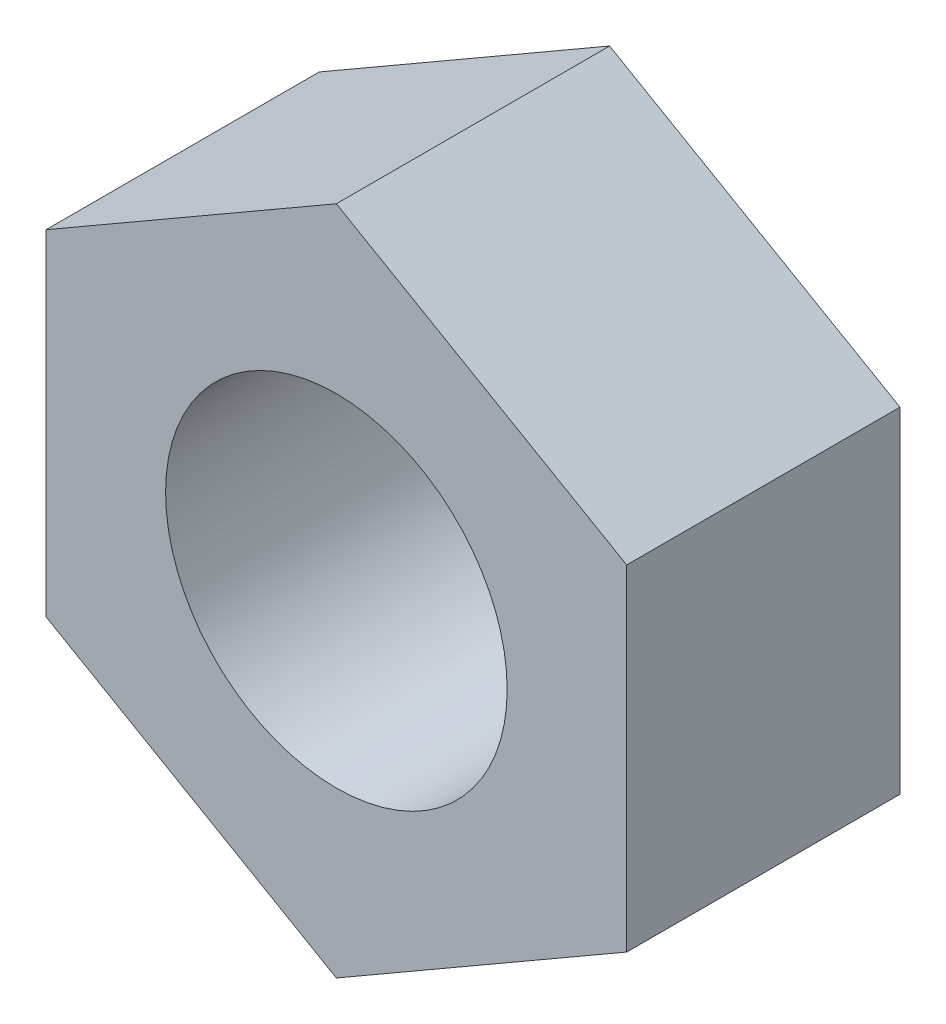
ISO-10303-21;
HEADER;
FILE_DESCRIPTION(('STEP AP214'),'2;1');
FILE_NAME('part.step','',(''),(''),'','','');
FILE_SCHEMA(('AUTOMOTIVE_DESIGN { 1 0 10303 214 1 1 1 1 }'));
ENDSEC;
DATA;
#1=APPLICATION_CONTEXT('core data for automotive mechanical design processes');
#2=APPLICATION_PROTOCOL_DEFINITION('international standard','automotive_design',2000,#1);
#3=PRODUCT_CONTEXT('',#1,'mechanical');
#4=PRODUCT('Part','Part','',(#3));
#5=PRODUCT_RELATED_PRODUCT_CATEGORY('part','',(#4));
#6=PRODUCT_DEFINITION_FORMATION('','',#4);
#7=PRODUCT_DEFINITION_CONTEXT('part definition',#1,'design');
#8=PRODUCT_DEFINITION('design','',#6,#7);
#9=PRODUCT_DEFINITION_SHAPE('','',#8);
#10=(LENGTH_UNIT() NAMED_UNIT(*) SI_UNIT(.MILLI.,.METRE.));
#11=(NAMED_UNIT(*) PLANE_ANGLE_UNIT() SI_UNIT($,.RADIAN.));
#12=(NAMED_UNIT(*) SI_UNIT($,.STERADIAN.) SOLID_ANGLE_UNIT());
#13=UNCERTAINTY_MEASURE_WITH_UNIT(LENGTH_MEASURE(1.E-05),#10,'distance_accuracy_value','');
#14=(GEOMETRIC_REPRESENTATION_CONTEXT(3) GLOBAL_UNCERTAINTY_ASSIGNED_CONTEXT((#13)) GLOBAL_UNIT_ASSIGNED_CONTEXT((#10,
#11,#12)) REPRESENTATION_CONTEXT('',''));
#15=CARTESIAN_POINT('',(0.,0.,0.));
#16=DIRECTION('',(0.,0.,1.));
#17=DIRECTION('',(1.,0.,0.));
#18=AXIS2_PLACEMENT_3D('',#15,#16,#17);
#19=CARTESIAN_POINT('',(0.,0.,8.));
#20=DIRECTION('',(0.,0.,1.));
#21=DIRECTION('',(1.,0.,0.));
#22=AXIS2_PLACEMENT_3D('',#19,#20,#21);
#23=PLANE('',#22);
#24=DIRECTION('',(0.866025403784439,0.5,0.));
#25=VECTOR('',#24,1.);
#26=CARTESIAN_POINT('',(0.,-9.81495457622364,8.));
#27=LINE('',#26,#25);
#28=CARTESIAN_POINT('',(0.,-9.81495457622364,8.));
#29=VERTEX_POINT('',#28);
#30=CARTESIAN_POINT('',(8.5,-4.90747728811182,8.));
#31=VERTEX_POINT('',#30);
#32=EDGE_CURVE('E129',#29,#31,#27,.T.);
#33=ORIENTED_EDGE('',*,*,#32,.T.);
#34=DIRECTION('',(0.,1.,0.));
#35=VECTOR('',#34,1.);
#36=CARTESIAN_POINT('',(8.5,-4.90747728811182,8.));
#37=LINE('',#36,#35);
#38=CARTESIAN_POINT('',(8.5,4.90747728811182,8.));
#39=VERTEX_POINT('',#38);
#40=EDGE_CURVE('E87',#31,#39,#37,.T.);
#41=ORIENTED_EDGE('',*,*,#40,.T.);
#42=DIRECTION('',(-0.866025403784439,0.5,0.));
#43=VECTOR('',#42,1.);
#44=CARTESIAN_POINT('',(8.5,4.90747728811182,8.));
#45=LINE('',#44,#43);
#46=CARTESIAN_POINT('',(0.,9.81495457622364,8.));
#47=VERTEX_POINT('',#46);
#48=EDGE_CURVE('E100',#39,#47,#45,.T.);
#49=ORIENTED_EDGE('',*,*,#48,.T.);
#50=DIRECTION('',(-0.866025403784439,-0.5,0.));
#51=VECTOR('',#50,1.);
#52=CARTESIAN_POINT('',(0.,9.81495457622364,8.));
#53=LINE('',#52,#51);
#54=CARTESIAN_POINT('',(-8.5,4.90747728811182,8.));
#55=VERTEX_POINT('',#54);
#56=EDGE_CURVE('E94',#47,#55,#53,.T.);
#57=ORIENTED_EDGE('',*,*,#56,.T.);
#58=DIRECTION('',(0.,-1.,0.));
#59=VECTOR('',#58,1.);
#60=CARTESIAN_POINT('',(-8.5,4.90747728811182,8.));
#61=LINE('',#60,#59);
#62=CARTESIAN_POINT('',(-8.5,-4.90747728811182,8.));
#63=VERTEX_POINT('',#62);
#64=EDGE_CURVE('E98',#55,#63,#61,.T.);
#65=ORIENTED_EDGE('',*,*,#64,.T.);
#66=DIRECTION('',(0.866025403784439,-0.5,0.));
#67=VECTOR('',#66,1.);
#68=CARTESIAN_POINT('',(-8.5,-4.90747728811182,8.));
#69=LINE('',#68,#67);
#70=EDGE_CURVE('E50',#63,#29,#69,.T.);
#71=ORIENTED_EDGE('',*,*,#70,.T.);
#72=EDGE_LOOP('',(#33,#41,#49,#57,#65,#71));
#73=FACE_BOUND('',#72,.T.);
#74=CARTESIAN_POINT('',(0.,0.,8.));
#75=DIRECTION('',(0.,0.,1.));
#76=DIRECTION('',(1.,0.,0.));
#77=AXIS2_PLACEMENT_3D('',#74,#75,#76);
#78=CIRCLE('',#77,5.);
#79=CARTESIAN_POINT('',(5.,0.,8.));
#80=VERTEX_POINT('',#79);
#81=EDGE_CURVE('E122',#80,#80,#78,.T.);
#82=ORIENTED_EDGE('',*,*,#81,.F.);
#83=EDGE_LOOP('',(#82));
#84=FACE_BOUND('',#83,.T.);
#85=ADVANCED_FACE('F33',(#73,#84),#23,.T.);
#86=CARTESIAN_POINT('',(0.,0.,0.));
#87=DIRECTION('',(0.,0.,1.));
#88=DIRECTION('',(1.,0.,0.));
#89=AXIS2_PLACEMENT_3D('',#86,#87,#88);
#90=PLANE('',#89);
#91=DIRECTION('',(0.866025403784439,0.5,0.));
#92=VECTOR('',#91,1.);
#93=CARTESIAN_POINT('',(0.,-9.81495457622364,0.));
#94=LINE('',#93,#92);
#95=CARTESIAN_POINT('',(0.,-9.81495457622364,0.));
#96=VERTEX_POINT('',#95);
#97=CARTESIAN_POINT('',(8.5,-4.90747728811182,0.));
#98=VERTEX_POINT('',#97);
#99=EDGE_CURVE('E118',#96,#98,#94,.T.);
#100=ORIENTED_EDGE('',*,*,#99,.F.);
#101=DIRECTION('',(0.866025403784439,-0.5,0.));
#102=VECTOR('',#101,1.);
#103=CARTESIAN_POINT('',(-8.5,-4.90747728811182,0.));
#104=LINE('',#103,#102);
#105=CARTESIAN_POINT('',(-8.5,-4.90747728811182,0.));
#106=VERTEX_POINT('',#105);
#107=EDGE_CURVE('E79',#106,#96,#104,.T.);
#108=ORIENTED_EDGE('',*,*,#107,.F.);
#109=DIRECTION('',(0.,-1.,0.));
#110=VECTOR('',#109,1.);
#111=CARTESIAN_POINT('',(-8.5,4.90747728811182,0.));
#112=LINE('',#111,#110);
#113=CARTESIAN_POINT('',(-8.5,4.90747728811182,0.));
#114=VERTEX_POINT('',#113);
#115=EDGE_CURVE('E73',#114,#106,#112,.T.);
#116=ORIENTED_EDGE('',*,*,#115,.F.);
#117=DIRECTION('',(-0.866025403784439,-0.5,0.));
#118=VECTOR('',#117,1.);
#119=CARTESIAN_POINT('',(0.,9.81495457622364,0.));
#120=LINE('',#119,#118);
#121=CARTESIAN_POINT('',(0.,9.81495457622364,0.));
#122=VERTEX_POINT('',#121);
#123=EDGE_CURVE('E108',#122,#114,#120,.T.);
#124=ORIENTED_EDGE('',*,*,#123,.F.);
#125=DIRECTION('',(-0.866025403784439,0.5,0.));
#126=VECTOR('',#125,1.);
#127=CARTESIAN_POINT('',(8.5,4.90747728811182,0.));
#128=LINE('',#127,#126);
#129=CARTESIAN_POINT('',(8.5,4.90747728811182,0.));
#130=VERTEX_POINT('',#129);
#131=EDGE_CURVE('E124',#130,#122,#128,.T.);
#132=ORIENTED_EDGE('',*,*,#131,.F.);
#133=DIRECTION('',(0.,1.,0.));
#134=VECTOR('',#133,1.);
#135=CARTESIAN_POINT('',(8.5,-4.90747728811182,0.));
#136=LINE('',#135,#134);
#137=EDGE_CURVE('E121',#98,#130,#136,.T.);
#138=ORIENTED_EDGE('',*,*,#137,.F.);
#139=EDGE_LOOP('',(#100,#108,#116,#124,#132,#138));
#140=FACE_BOUND('',#139,.T.);
#141=CARTESIAN_POINT('',(0.,0.,0.));
#142=DIRECTION('',(0.,0.,1.));
#143=DIRECTION('',(1.,0.,0.));
#144=AXIS2_PLACEMENT_3D('',#141,#142,#143);
#145=CIRCLE('',#144,5.);
#146=CARTESIAN_POINT('',(5.,0.,0.));
#147=VERTEX_POINT('',#146);
#148=EDGE_CURVE('E222',#147,#147,#145,.T.);
#149=ORIENTED_EDGE('',*,*,#148,.T.);
#150=EDGE_LOOP('',(#149));
#151=FACE_BOUND('',#150,.T.);
#152=ADVANCED_FACE('F138',(#140,#151),#90,.F.);
#153=CARTESIAN_POINT('',(0.,-9.81495457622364,8.));
#154=DIRECTION('',(-0.5,0.866025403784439,0.));
#155=DIRECTION('',(-0.866025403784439,-0.5,0.));
#156=AXIS2_PLACEMENT_3D('',#153,#154,#155);
#157=PLANE('',#156);
#158=ORIENTED_EDGE('',*,*,#99,.T.);
#159=DIRECTION('',(0.,0.,-1.));
#160=VECTOR('',#159,1.);
#161=CARTESIAN_POINT('',(8.5,-4.90747728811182,8.));
#162=LINE('',#161,#160);
#163=EDGE_CURVE('E11',#31,#98,#162,.T.);
#164=ORIENTED_EDGE('',*,*,#163,.F.);
#165=ORIENTED_EDGE('',*,*,#32,.F.);
#166=DIRECTION('',(0.,0.,-1.));
#167=VECTOR('',#166,1.);
#168=CARTESIAN_POINT('',(0.,-9.81495457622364,8.));
#169=LINE('',#168,#167);
#170=EDGE_CURVE('E114',#29,#96,#169,.T.);
#171=ORIENTED_EDGE('',*,*,#170,.T.);
#172=EDGE_LOOP('',(#158,#164,#165,#171));
#173=FACE_BOUND('',#172,.T.);
#174=ADVANCED_FACE('F35',(#173),#157,.F.);
#175=CARTESIAN_POINT('',(8.5,-4.90747728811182,8.));
#176=DIRECTION('',(-1.,0.,0.));
#177=DIRECTION('',(0.,0.,1.));
#178=AXIS2_PLACEMENT_3D('',#175,#176,#177);
#179=PLANE('',#178);
#180=ORIENTED_EDGE('',*,*,#137,.T.);
#181=DIRECTION('',(0.,0.,-1.));
#182=VECTOR('',#181,1.);
#183=CARTESIAN_POINT('',(8.5,4.90747728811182,8.));
#184=LINE('',#183,#182);
#185=EDGE_CURVE('E42',#39,#130,#184,.T.);
#186=ORIENTED_EDGE('',*,*,#185,.F.);
#187=ORIENTED_EDGE('',*,*,#40,.F.);
#188=ORIENTED_EDGE('',*,*,#163,.T.);
#189=EDGE_LOOP('',(#180,#186,#187,#188));
#190=FACE_BOUND('',#189,.T.);
#191=ADVANCED_FACE('F163',(#190),#179,.F.);
#192=CARTESIAN_POINT('',(8.5,4.90747728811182,8.));
#193=DIRECTION('',(-0.5,-0.866025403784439,0.));
#194=DIRECTION('',(0.866025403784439,-0.5,0.));
#195=AXIS2_PLACEMENT_3D('',#192,#193,#194);
#196=PLANE('',#195);
#197=ORIENTED_EDGE('',*,*,#131,.T.);
#198=DIRECTION('',(0.,0.,-1.));
#199=VECTOR('',#198,1.);
#200=CARTESIAN_POINT('',(0.,9.81495457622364,8.));
#201=LINE('',#200,#199);
#202=EDGE_CURVE('E109',#47,#122,#201,.T.);
#203=ORIENTED_EDGE('',*,*,#202,.F.);
#204=ORIENTED_EDGE('',*,*,#48,.F.);
#205=ORIENTED_EDGE('',*,*,#185,.T.);
#206=EDGE_LOOP('',(#197,#203,#204,#205));
#207=FACE_BOUND('',#206,.T.);
#208=ADVANCED_FACE('F135',(#207),#196,.F.);
#209=CARTESIAN_POINT('',(0.,9.81495457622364,8.));
#210=DIRECTION('',(0.5,-0.866025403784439,0.));
#211=DIRECTION('',(0.866025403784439,0.5,0.));
#212=AXIS2_PLACEMENT_3D('',#209,#210,#211);
#213=PLANE('',#212);
#214=ORIENTED_EDGE('',*,*,#123,.T.);
#215=DIRECTION('',(0.,0.,-1.));
#216=VECTOR('',#215,1.);
#217=CARTESIAN_POINT('',(-8.5,4.90747728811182,8.));
#218=LINE('',#217,#216);
#219=EDGE_CURVE('E105',#55,#114,#218,.T.);
#220=ORIENTED_EDGE('',*,*,#219,.F.);
#221=ORIENTED_EDGE('',*,*,#56,.F.);
#222=ORIENTED_EDGE('',*,*,#202,.T.);
#223=EDGE_LOOP('',(#214,#220,#221,#222));
#224=FACE_BOUND('',#223,.T.);
#225=ADVANCED_FACE('F106',(#224),#213,.F.);
#226=CARTESIAN_POINT('',(-8.5,4.90747728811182,8.));
#227=DIRECTION('',(1.,0.,0.));
#228=DIRECTION('',(0.,0.,-1.));
#229=AXIS2_PLACEMENT_3D('',#226,#227,#228);
#230=PLANE('',#229);
#231=ORIENTED_EDGE('',*,*,#115,.T.);
#232=DIRECTION('',(0.,0.,-1.));
#233=VECTOR('',#232,1.);
#234=CARTESIAN_POINT('',(-8.5,-4.90747728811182,8.));
#235=LINE('',#234,#233);
#236=EDGE_CURVE('E110',#63,#106,#235,.T.);
#237=ORIENTED_EDGE('',*,*,#236,.F.);
#238=ORIENTED_EDGE('',*,*,#64,.F.);
#239=ORIENTED_EDGE('',*,*,#219,.T.);
#240=EDGE_LOOP('',(#231,#237,#238,#239));
#241=FACE_BOUND('',#240,.T.);
#242=ADVANCED_FACE('F112',(#241),#230,.F.);
#243=CARTESIAN_POINT('',(-8.5,-4.90747728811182,8.));
#244=DIRECTION('',(0.5,0.866025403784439,0.));
#245=DIRECTION('',(-0.866025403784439,0.5,0.));
#246=AXIS2_PLACEMENT_3D('',#243,#244,#245);
#247=PLANE('',#246);
#248=ORIENTED_EDGE('',*,*,#107,.T.);
#249=ORIENTED_EDGE('',*,*,#170,.F.);
#250=ORIENTED_EDGE('',*,*,#70,.F.);
#251=ORIENTED_EDGE('',*,*,#236,.T.);
#252=EDGE_LOOP('',(#248,#249,#250,#251));
#253=FACE_BOUND('',#252,.T.);
#254=ADVANCED_FACE('F143',(#253),#247,.F.);
#255=CARTESIAN_POINT('',(0.,0.,8.));
#256=DIRECTION('',(0.,0.,-1.));
#257=DIRECTION('',(-1.,0.,0.));
#258=AXIS2_PLACEMENT_3D('',#255,#256,#257);
#259=CYLINDRICAL_SURFACE('',#258,5.);
#260=ORIENTED_EDGE('',*,*,#81,.T.);
#261=EDGE_LOOP('',(#260));
#262=FACE_BOUND('',#261,.T.);
#263=ORIENTED_EDGE('',*,*,#148,.F.);
#264=EDGE_LOOP('',(#263));
#265=FACE_BOUND('',#264,.T.);
#266=ADVANCED_FACE('F145',(#262,#265),#259,.F.);
#267=CLOSED_SHELL('',(#85,#152,#174,#191,#208,#225,#242,#254,#266));
#268=MANIFOLD_SOLID_BREP('B2',#267);
#269=ADVANCED_BREP_SHAPE_REPRESENTATION('',(#18,#268),#14);
#270=SHAPE_DEFINITION_REPRESENTATION(#9,#269);
ENDSEC;
END-ISO-10303-21;
